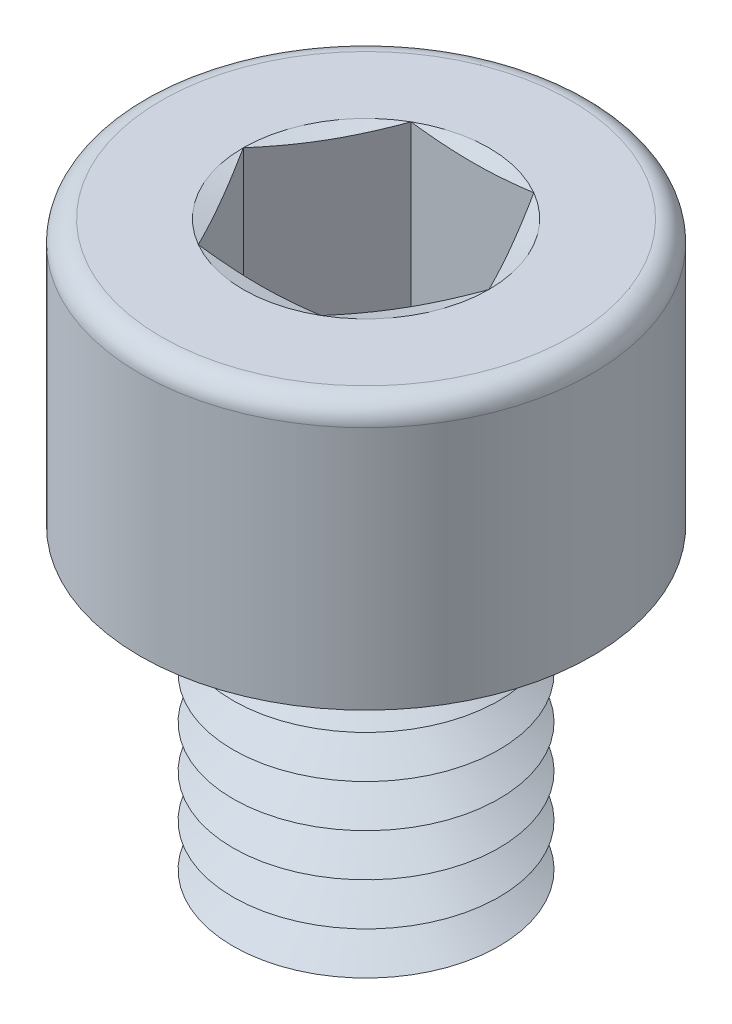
from build123d import *

# Parameters (mm, degrees)
SKETCH1_R       = 2.5
EXTRUDE1_DEPTH  = 6
SKETCH2_R       = 4.25
EXTRUDE2_DEPTH  = 5
EXTRUDE3_DEPTH  = 4
FILLET1_R       = 0.4
LPATTERN1_COUNT = 8
LPATTERN1_PITCH = 0.8


with BuildPart() as part:
    # Sketch1 → Extrude1 (new body)
    with BuildSketch(Plane(origin=(0, 0, 0), x_dir=(1, 0, 0), z_dir=(0, 1, 0))):
        with Locations(Location((0, 0, 0), (0, 0, 270))):
            Circle(SKETCH1_R)
    extrude(amount=EXTRUDE1_DEPTH)

    # Sketch2 → Extrude2 (add)
    with BuildSketch(Plane(origin=(0, 6, 0), x_dir=(1, 0, 0), z_dir=(0, 1, 0))):
        with Locations(Location((0, 0, 0), (0, 0, 270))):
            Circle(SKETCH2_R)
    extrude(amount=EXTRUDE2_DEPTH)

    # Sketch3 → Extrude3 (cut)
    with BuildSketch(Plane(origin=(0, 11, 0), x_dir=(1, 0, 0), z_dir=(0, 1, 0))):
        Polygon((1.154700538, 2), (-1.154700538, 2), (-2.309401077, 0), (-1.154700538, -2), (1.154700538, -2), (2.309401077, 0), align=None)
    extrude(amount=-EXTRUDE3_DEPTH, mode=Mode.SUBTRACT)

    # Fillet1
    fillet1_edges = [part.edges().sort_by_distance(p)[0] for p in [
        (0, 11, -4.25),
    ]]
    fillet(fillet1_edges, radius=FILLET1_R)

    # Sketch4 → Cut-Revolve1 (revolve, cut)
    with BuildSketch(Plane(origin=(0, 0, 0), x_dir=(0, 0, -1), z_dir=(1, 0, 0))):
        Polygon((-2, 7), (0, 7), (0, 5.845299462), align=None)
    revolve(axis=Axis((0, 7, 0), (0, -1, 0)), mode=Mode.SUBTRACT)

    # Sketch5 → Cut-Revolve2 (revolve, cut)
    with BuildSketch(Plane.XY, mode=Mode.PRIVATE) as cut_revolve2_sk:
        Polygon((-2.5, 0.4), (-2.5, -0.4), (-1.807179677, 0), align=None)
    cut_revolve2 = revolve(cut_revolve2_sk.sketch.rotate(Axis((0, 6, 0), (0, -1, 0)), 270), axis=Axis((0, 6, 0), (0, -1, 0)), mode=Mode.SUBTRACT)

    # LPattern1: Cut-Revolve2 ×8
    with Locations(*[(0, i * LPATTERN1_PITCH, 0) for i in range(1, LPATTERN1_COUNT)]):
        add(cut_revolve2, mode=Mode.SUBTRACT)

    # Extrude4 cone 1 section (on through the dimple's axis) → Extrude4 (revolve, cut)
    with BuildSketch(Plane(origin=(0, 11, 0), x_dir=(0, 0, 1), z_dir=(1, 0, 0))):
        Polygon((0, 0), (2.309401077, 0), (0, 0.618802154), align=None)
    revolve(axis=Axis((0, 11, 0), (0, -1, 0)), mode=Mode.SUBTRACT)


solid = part.part
